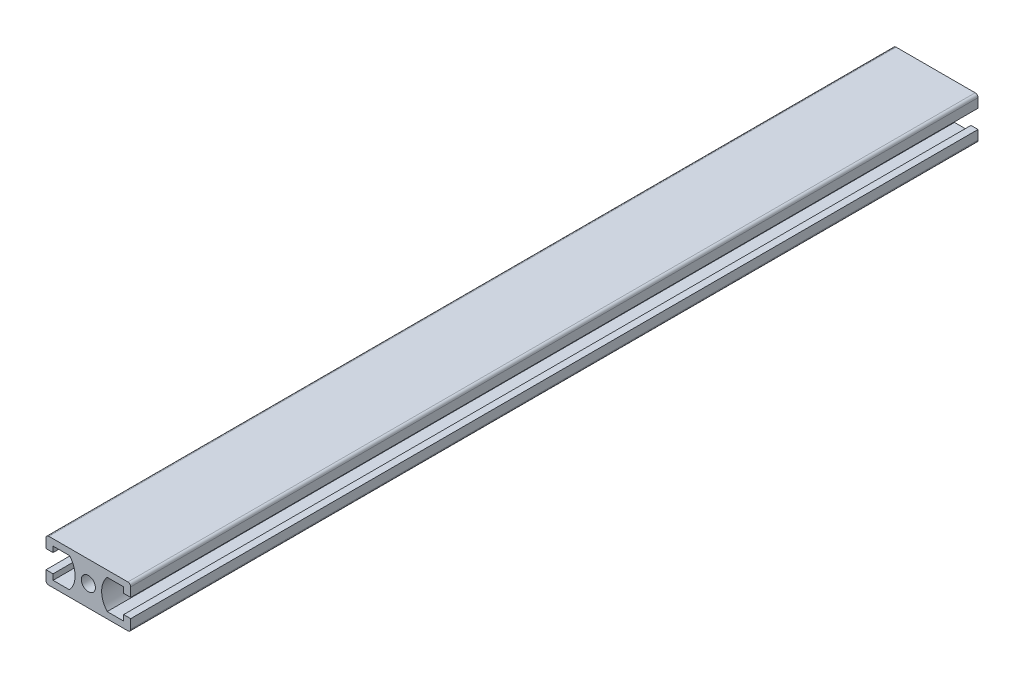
ISO-10303-21;
HEADER;
FILE_DESCRIPTION(('STEP AP214'),'2;1');
FILE_NAME('part.step','',(''),(''),'','','');
FILE_SCHEMA(('AUTOMOTIVE_DESIGN { 1 0 10303 214 1 1 1 1 }'));
ENDSEC;
DATA;
#1=APPLICATION_CONTEXT('core data for automotive mechanical design processes');
#2=APPLICATION_PROTOCOL_DEFINITION('international standard','automotive_design',2000,#1);
#3=PRODUCT_CONTEXT('',#1,'mechanical');
#4=PRODUCT('Part','Part','',(#3));
#5=PRODUCT_RELATED_PRODUCT_CATEGORY('part','',(#4));
#6=PRODUCT_DEFINITION_FORMATION('','',#4);
#7=PRODUCT_DEFINITION_CONTEXT('part definition',#1,'design');
#8=PRODUCT_DEFINITION('design','',#6,#7);
#9=PRODUCT_DEFINITION_SHAPE('','',#8);
#10=(LENGTH_UNIT() NAMED_UNIT(*) SI_UNIT(.MILLI.,.METRE.));
#11=(NAMED_UNIT(*) PLANE_ANGLE_UNIT() SI_UNIT($,.RADIAN.));
#12=(NAMED_UNIT(*) SI_UNIT($,.STERADIAN.) SOLID_ANGLE_UNIT());
#13=UNCERTAINTY_MEASURE_WITH_UNIT(LENGTH_MEASURE(1.E-05),#10,'distance_accuracy_value','');
#14=(GEOMETRIC_REPRESENTATION_CONTEXT(3) GLOBAL_UNCERTAINTY_ASSIGNED_CONTEXT((#13)) GLOBAL_UNIT_ASSIGNED_CONTEXT((#10,
#11,#12)) REPRESENTATION_CONTEXT('',''));
#15=CARTESIAN_POINT('',(0.,0.,0.));
#16=DIRECTION('',(0.,0.,1.));
#17=DIRECTION('',(1.,0.,0.));
#18=AXIS2_PLACEMENT_3D('',#15,#16,#17);
#19=CARTESIAN_POINT('',(-12.6999999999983,0.,150.));
#20=DIRECTION('',(0.,0.,1.));
#21=DIRECTION('',(1.,0.,0.));
#22=AXIS2_PLACEMENT_3D('',#19,#20,#21);
#23=PLANE('',#22);
#24=CARTESIAN_POINT('',(-12.6999999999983,0.,150.));
#25=DIRECTION('',(0.,0.,-1.));
#26=DIRECTION('',(1.,0.,0.));
#27=AXIS2_PLACEMENT_3D('',#24,#25,#26);
#28=CIRCLE('',#27,7.99999999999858);
#29=CARTESIAN_POINT('',(-6.66365176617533,5.25000000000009,150.));
#30=VERTEX_POINT('',#29);
#31=CARTESIAN_POINT('',(-6.66365176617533,-5.24999999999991,150.));
#32=VERTEX_POINT('',#31);
#33=EDGE_CURVE('E309',#30,#32,#28,.T.);
#34=ORIENTED_EDGE('',*,*,#33,.T.);
#35=DIRECTION('',(-1.,0.,0.));
#36=VECTOR('',#35,1.);
#37=CARTESIAN_POINT('',(-6.66365176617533,-5.24999999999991,150.));
#38=LINE('',#37,#36);
#39=CARTESIAN_POINT('',(-12.4999999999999,-5.24999999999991,150.));
#40=VERTEX_POINT('',#39);
#41=EDGE_CURVE('E148',#32,#40,#38,.T.);
#42=ORIENTED_EDGE('',*,*,#41,.T.);
#43=DIRECTION('',(0.,1.,0.));
#44=VECTOR('',#43,1.);
#45=CARTESIAN_POINT('',(-12.4999999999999,-5.24999999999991,150.));
#46=LINE('',#45,#44);
#47=CARTESIAN_POINT('',(-12.4999999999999,-3.24999999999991,150.));
#48=VERTEX_POINT('',#47);
#49=EDGE_CURVE('E394',#40,#48,#46,.T.);
#50=ORIENTED_EDGE('',*,*,#49,.T.);
#51=DIRECTION('',(-1.,0.,0.));
#52=VECTOR('',#51,1.);
#53=CARTESIAN_POINT('',(-12.4999999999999,-3.24999999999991,150.));
#54=LINE('',#53,#52);
#55=CARTESIAN_POINT('',(-14.9999999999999,-3.24999999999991,150.));
#56=VERTEX_POINT('',#55);
#57=EDGE_CURVE('E414',#48,#56,#54,.T.);
#58=ORIENTED_EDGE('',*,*,#57,.T.);
#59=DIRECTION('',(0.,-1.,0.));
#60=VECTOR('',#59,1.);
#61=CARTESIAN_POINT('',(-14.9999999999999,-3.24999999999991,150.));
#62=LINE('',#61,#60);
#63=CARTESIAN_POINT('',(-14.9999999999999,-6.49999999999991,150.));
#64=VERTEX_POINT('',#63);
#65=EDGE_CURVE('E410',#56,#64,#62,.T.);
#66=ORIENTED_EDGE('',*,*,#65,.T.);
#67=CARTESIAN_POINT('',(-13.9999999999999,-6.49999999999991,150.));
#68=DIRECTION('',(0.,0.,1.));
#69=DIRECTION('',(1.,0.,0.));
#70=AXIS2_PLACEMENT_3D('',#67,#68,#69);
#71=CIRCLE('',#70,1.);
#72=CARTESIAN_POINT('',(-13.9999999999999,-7.49999999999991,150.));
#73=VERTEX_POINT('',#72);
#74=EDGE_CURVE('E413',#64,#73,#71,.T.);
#75=ORIENTED_EDGE('',*,*,#74,.T.);
#76=DIRECTION('',(1.,0.,0.));
#77=VECTOR('',#76,1.);
#78=CARTESIAN_POINT('',(-13.9999999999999,-7.49999999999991,150.));
#79=LINE('',#78,#77);
#80=CARTESIAN_POINT('',(14.0000000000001,-7.49999999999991,150.));
#81=VERTEX_POINT('',#80);
#82=EDGE_CURVE('E418',#73,#81,#79,.T.);
#83=ORIENTED_EDGE('',*,*,#82,.T.);
#84=CARTESIAN_POINT('',(14.0000000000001,-6.49999999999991,150.));
#85=DIRECTION('',(0.,0.,1.));
#86=DIRECTION('',(1.,0.,0.));
#87=AXIS2_PLACEMENT_3D('',#84,#85,#86);
#88=CIRCLE('',#87,0.999999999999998);
#89=CARTESIAN_POINT('',(15.0000000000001,-6.49999999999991,150.));
#90=VERTEX_POINT('',#89);
#91=EDGE_CURVE('E426',#81,#90,#88,.T.);
#92=ORIENTED_EDGE('',*,*,#91,.T.);
#93=DIRECTION('',(0.,1.,0.));
#94=VECTOR('',#93,1.);
#95=CARTESIAN_POINT('',(15.0000000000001,-6.49999999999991,150.));
#96=LINE('',#95,#94);
#97=CARTESIAN_POINT('',(15.0000000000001,-3.24999999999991,150.));
#98=VERTEX_POINT('',#97);
#99=EDGE_CURVE('E429',#90,#98,#96,.T.);
#100=ORIENTED_EDGE('',*,*,#99,.T.);
#101=DIRECTION('',(-1.,0.,0.));
#102=VECTOR('',#101,1.);
#103=CARTESIAN_POINT('',(15.0000000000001,-3.24999999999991,150.));
#104=LINE('',#103,#102);
#105=CARTESIAN_POINT('',(12.5000000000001,-3.24999999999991,150.));
#106=VERTEX_POINT('',#105);
#107=EDGE_CURVE('E432',#98,#106,#104,.T.);
#108=ORIENTED_EDGE('',*,*,#107,.T.);
#109=DIRECTION('',(0.,-1.,0.));
#110=VECTOR('',#109,1.);
#111=CARTESIAN_POINT('',(12.5000000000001,-3.24999999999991,150.));
#112=LINE('',#111,#110);
#113=CARTESIAN_POINT('',(12.5000000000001,-5.24999999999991,150.));
#114=VERTEX_POINT('',#113);
#115=EDGE_CURVE('E435',#106,#114,#112,.T.);
#116=ORIENTED_EDGE('',*,*,#115,.T.);
#117=DIRECTION('',(-1.,0.,0.));
#118=VECTOR('',#117,1.);
#119=CARTESIAN_POINT('',(12.5000000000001,-5.24999999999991,150.));
#120=LINE('',#119,#118);
#121=CARTESIAN_POINT('',(6.6636517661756,-5.24999999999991,150.));
#122=VERTEX_POINT('',#121);
#123=EDGE_CURVE('E438',#114,#122,#120,.T.);
#124=ORIENTED_EDGE('',*,*,#123,.T.);
#125=CARTESIAN_POINT('',(12.6999999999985,0.,150.));
#126=DIRECTION('',(0.,0.,-1.));
#127=DIRECTION('',(1.,0.,0.));
#128=AXIS2_PLACEMENT_3D('',#125,#126,#127);
#129=CIRCLE('',#128,7.99999999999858);
#130=CARTESIAN_POINT('',(6.6636517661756,5.25000000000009,150.));
#131=VERTEX_POINT('',#130);
#132=EDGE_CURVE('E441',#122,#131,#129,.T.);
#133=ORIENTED_EDGE('',*,*,#132,.T.);
#134=DIRECTION('',(1.,0.,0.));
#135=VECTOR('',#134,1.);
#136=CARTESIAN_POINT('',(6.6636517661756,5.25000000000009,150.));
#137=LINE('',#136,#135);
#138=CARTESIAN_POINT('',(12.5000000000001,5.25000000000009,150.));
#139=VERTEX_POINT('',#138);
#140=EDGE_CURVE('E444',#131,#139,#137,.T.);
#141=ORIENTED_EDGE('',*,*,#140,.T.);
#142=DIRECTION('',(0.,-1.,0.));
#143=VECTOR('',#142,1.);
#144=CARTESIAN_POINT('',(12.5000000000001,5.25000000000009,150.));
#145=LINE('',#144,#143);
#146=CARTESIAN_POINT('',(12.5000000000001,3.25000000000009,150.));
#147=VERTEX_POINT('',#146);
#148=EDGE_CURVE('E447',#139,#147,#145,.T.);
#149=ORIENTED_EDGE('',*,*,#148,.T.);
#150=DIRECTION('',(1.,0.,0.));
#151=VECTOR('',#150,1.);
#152=CARTESIAN_POINT('',(12.5000000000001,3.25000000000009,150.));
#153=LINE('',#152,#151);
#154=CARTESIAN_POINT('',(15.0000000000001,3.25000000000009,150.));
#155=VERTEX_POINT('',#154);
#156=EDGE_CURVE('E450',#147,#155,#153,.T.);
#157=ORIENTED_EDGE('',*,*,#156,.T.);
#158=DIRECTION('',(0.,1.,0.));
#159=VECTOR('',#158,1.);
#160=CARTESIAN_POINT('',(15.0000000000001,3.25000000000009,150.));
#161=LINE('',#160,#159);
#162=CARTESIAN_POINT('',(15.0000000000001,6.50000000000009,150.));
#163=VERTEX_POINT('',#162);
#164=EDGE_CURVE('E453',#155,#163,#161,.T.);
#165=ORIENTED_EDGE('',*,*,#164,.T.);
#166=CARTESIAN_POINT('',(14.0000000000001,6.50000000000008,150.));
#167=DIRECTION('',(0.,0.,1.));
#168=DIRECTION('',(1.,0.,0.));
#169=AXIS2_PLACEMENT_3D('',#166,#167,#168);
#170=CIRCLE('',#169,1.00000000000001);
#171=CARTESIAN_POINT('',(14.0000000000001,7.50000000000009,150.));
#172=VERTEX_POINT('',#171);
#173=EDGE_CURVE('E455',#163,#172,#170,.T.);
#174=ORIENTED_EDGE('',*,*,#173,.T.);
#175=DIRECTION('',(-1.,0.,0.));
#176=VECTOR('',#175,1.);
#177=CARTESIAN_POINT('',(14.0000000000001,7.50000000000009,150.));
#178=LINE('',#177,#176);
#179=CARTESIAN_POINT('',(-13.9999999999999,7.50000000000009,150.));
#180=VERTEX_POINT('',#179);
#181=EDGE_CURVE('E458',#172,#180,#178,.T.);
#182=ORIENTED_EDGE('',*,*,#181,.T.);
#183=CARTESIAN_POINT('',(-13.9999999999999,6.50000000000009,150.));
#184=DIRECTION('',(0.,0.,1.));
#185=DIRECTION('',(1.,0.,0.));
#186=AXIS2_PLACEMENT_3D('',#183,#184,#185);
#187=CIRCLE('',#186,0.999999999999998);
#188=CARTESIAN_POINT('',(-14.9999999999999,6.50000000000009,150.));
#189=VERTEX_POINT('',#188);
#190=EDGE_CURVE('E461',#180,#189,#187,.T.);
#191=ORIENTED_EDGE('',*,*,#190,.T.);
#192=DIRECTION('',(0.,-1.,0.));
#193=VECTOR('',#192,1.);
#194=CARTESIAN_POINT('',(-14.9999999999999,6.50000000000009,150.));
#195=LINE('',#194,#193);
#196=CARTESIAN_POINT('',(-14.9999999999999,3.25000000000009,150.));
#197=VERTEX_POINT('',#196);
#198=EDGE_CURVE('E215',#189,#197,#195,.T.);
#199=ORIENTED_EDGE('',*,*,#198,.T.);
#200=DIRECTION('',(1.,0.,0.));
#201=VECTOR('',#200,1.);
#202=CARTESIAN_POINT('',(-14.9999999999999,3.25000000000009,150.));
#203=LINE('',#202,#201);
#204=CARTESIAN_POINT('',(-12.4999999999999,3.25000000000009,150.));
#205=VERTEX_POINT('',#204);
#206=EDGE_CURVE('E209',#197,#205,#203,.T.);
#207=ORIENTED_EDGE('',*,*,#206,.T.);
#208=DIRECTION('',(0.,1.,0.));
#209=VECTOR('',#208,1.);
#210=CARTESIAN_POINT('',(-12.4999999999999,3.25000000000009,150.));
#211=LINE('',#210,#209);
#212=CARTESIAN_POINT('',(-12.4999999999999,5.25000000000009,150.));
#213=VERTEX_POINT('',#212);
#214=EDGE_CURVE('E213',#205,#213,#211,.T.);
#215=ORIENTED_EDGE('',*,*,#214,.T.);
#216=DIRECTION('',(1.,0.,0.));
#217=VECTOR('',#216,1.);
#218=CARTESIAN_POINT('',(-12.4999999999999,5.25000000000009,150.));
#219=LINE('',#218,#217);
#220=EDGE_CURVE('E57',#213,#30,#219,.T.);
#221=ORIENTED_EDGE('',*,*,#220,.T.);
#222=EDGE_LOOP('',(#34,#42,#50,#58,#66,#75,#83,#92,#100,#108,#116,#124,#133,#141,#149,#157,#165,
#174,#182,#191,#199,#207,#215,#221));
#223=FACE_BOUND('',#222,.T.);
#224=CARTESIAN_POINT('',(1.35308431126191E-13,0.,150.));
#225=DIRECTION('',(0.,0.,1.));
#226=DIRECTION('',(1.,0.,0.));
#227=AXIS2_PLACEMENT_3D('',#224,#225,#226);
#228=CIRCLE('',#227,2.5);
#229=CARTESIAN_POINT('',(2.50000000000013,0.,150.));
#230=VERTEX_POINT('',#229);
#231=EDGE_CURVE('E244',#230,#230,#228,.T.);
#232=ORIENTED_EDGE('',*,*,#231,.F.);
#233=EDGE_LOOP('',(#232));
#234=FACE_BOUND('',#233,.T.);
#235=ADVANCED_FACE('F39',(#223,#234),#23,.T.);
#236=CARTESIAN_POINT('',(-12.6999999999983,0.,-150.));
#237=DIRECTION('',(0.,0.,1.));
#238=DIRECTION('',(1.,0.,0.));
#239=AXIS2_PLACEMENT_3D('',#236,#237,#238);
#240=PLANE('',#239);
#241=CARTESIAN_POINT('',(-12.6999999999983,0.,-150.));
#242=DIRECTION('',(0.,0.,-1.));
#243=DIRECTION('',(1.,0.,0.));
#244=AXIS2_PLACEMENT_3D('',#241,#242,#243);
#245=CIRCLE('',#244,7.99999999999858);
#246=CARTESIAN_POINT('',(-6.66365176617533,5.25000000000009,-150.));
#247=VERTEX_POINT('',#246);
#248=CARTESIAN_POINT('',(-6.66365176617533,-5.24999999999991,-150.));
#249=VERTEX_POINT('',#248);
#250=EDGE_CURVE('E239',#247,#249,#245,.T.);
#251=ORIENTED_EDGE('',*,*,#250,.F.);
#252=DIRECTION('',(1.,0.,0.));
#253=VECTOR('',#252,1.);
#254=CARTESIAN_POINT('',(-12.4999999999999,5.25000000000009,-150.));
#255=LINE('',#254,#253);
#256=CARTESIAN_POINT('',(-12.4999999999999,5.25000000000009,-150.));
#257=VERTEX_POINT('',#256);
#258=EDGE_CURVE('E140',#257,#247,#255,.T.);
#259=ORIENTED_EDGE('',*,*,#258,.F.);
#260=DIRECTION('',(0.,1.,0.));
#261=VECTOR('',#260,1.);
#262=CARTESIAN_POINT('',(-12.4999999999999,3.25000000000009,-150.));
#263=LINE('',#262,#261);
#264=CARTESIAN_POINT('',(-12.4999999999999,3.25000000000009,-150.));
#265=VERTEX_POINT('',#264);
#266=EDGE_CURVE('E134',#265,#257,#263,.T.);
#267=ORIENTED_EDGE('',*,*,#266,.F.);
#268=DIRECTION('',(1.,0.,0.));
#269=VECTOR('',#268,1.);
#270=CARTESIAN_POINT('',(-14.9999999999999,3.25000000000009,-150.));
#271=LINE('',#270,#269);
#272=CARTESIAN_POINT('',(-14.9999999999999,3.25000000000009,-150.));
#273=VERTEX_POINT('',#272);
#274=EDGE_CURVE('E224',#273,#265,#271,.T.);
#275=ORIENTED_EDGE('',*,*,#274,.F.);
#276=DIRECTION('',(0.,-1.,0.));
#277=VECTOR('',#276,1.);
#278=CARTESIAN_POINT('',(-14.9999999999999,6.50000000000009,-150.));
#279=LINE('',#278,#277);
#280=CARTESIAN_POINT('',(-14.9999999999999,6.50000000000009,-150.));
#281=VERTEX_POINT('',#280);
#282=EDGE_CURVE('E300',#281,#273,#279,.T.);
#283=ORIENTED_EDGE('',*,*,#282,.F.);
#284=CARTESIAN_POINT('',(-13.9999999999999,6.50000000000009,-150.));
#285=DIRECTION('',(0.,0.,1.));
#286=DIRECTION('',(1.,0.,0.));
#287=AXIS2_PLACEMENT_3D('',#284,#285,#286);
#288=CIRCLE('',#287,0.999999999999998);
#289=CARTESIAN_POINT('',(-13.9999999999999,7.50000000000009,-150.));
#290=VERTEX_POINT('',#289);
#291=EDGE_CURVE('E297',#290,#281,#288,.T.);
#292=ORIENTED_EDGE('',*,*,#291,.F.);
#293=DIRECTION('',(-1.,0.,0.));
#294=VECTOR('',#293,1.);
#295=CARTESIAN_POINT('',(14.0000000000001,7.50000000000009,-150.));
#296=LINE('',#295,#294);
#297=CARTESIAN_POINT('',(14.0000000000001,7.50000000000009,-150.));
#298=VERTEX_POINT('',#297);
#299=EDGE_CURVE('E294',#298,#290,#296,.T.);
#300=ORIENTED_EDGE('',*,*,#299,.F.);
#301=CARTESIAN_POINT('',(14.0000000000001,6.50000000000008,-150.));
#302=DIRECTION('',(0.,0.,1.));
#303=DIRECTION('',(1.,0.,0.));
#304=AXIS2_PLACEMENT_3D('',#301,#302,#303);
#305=CIRCLE('',#304,1.00000000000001);
#306=CARTESIAN_POINT('',(15.0000000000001,6.50000000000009,-150.));
#307=VERTEX_POINT('',#306);
#308=EDGE_CURVE('E291',#307,#298,#305,.T.);
#309=ORIENTED_EDGE('',*,*,#308,.F.);
#310=DIRECTION('',(0.,1.,0.));
#311=VECTOR('',#310,1.);
#312=CARTESIAN_POINT('',(15.0000000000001,3.25000000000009,-150.));
#313=LINE('',#312,#311);
#314=CARTESIAN_POINT('',(15.0000000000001,3.25000000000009,-150.));
#315=VERTEX_POINT('',#314);
#316=EDGE_CURVE('E288',#315,#307,#313,.T.);
#317=ORIENTED_EDGE('',*,*,#316,.F.);
#318=DIRECTION('',(1.,0.,0.));
#319=VECTOR('',#318,1.);
#320=CARTESIAN_POINT('',(12.5000000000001,3.25000000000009,-150.));
#321=LINE('',#320,#319);
#322=CARTESIAN_POINT('',(12.5000000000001,3.25000000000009,-150.));
#323=VERTEX_POINT('',#322);
#324=EDGE_CURVE('E285',#323,#315,#321,.T.);
#325=ORIENTED_EDGE('',*,*,#324,.F.);
#326=DIRECTION('',(0.,-1.,0.));
#327=VECTOR('',#326,1.);
#328=CARTESIAN_POINT('',(12.5000000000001,5.25000000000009,-150.));
#329=LINE('',#328,#327);
#330=CARTESIAN_POINT('',(12.5000000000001,5.25000000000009,-150.));
#331=VERTEX_POINT('',#330);
#332=EDGE_CURVE('E282',#331,#323,#329,.T.);
#333=ORIENTED_EDGE('',*,*,#332,.F.);
#334=DIRECTION('',(1.,0.,0.));
#335=VECTOR('',#334,1.);
#336=CARTESIAN_POINT('',(6.6636517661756,5.25000000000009,-150.));
#337=LINE('',#336,#335);
#338=CARTESIAN_POINT('',(6.6636517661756,5.25000000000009,-150.));
#339=VERTEX_POINT('',#338);
#340=EDGE_CURVE('E280',#339,#331,#337,.T.);
#341=ORIENTED_EDGE('',*,*,#340,.F.);
#342=CARTESIAN_POINT('',(12.6999999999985,0.,-150.));
#343=DIRECTION('',(0.,0.,-1.));
#344=DIRECTION('',(1.,0.,0.));
#345=AXIS2_PLACEMENT_3D('',#342,#343,#344);
#346=CIRCLE('',#345,7.99999999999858);
#347=CARTESIAN_POINT('',(6.6636517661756,-5.24999999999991,-150.));
#348=VERTEX_POINT('',#347);
#349=EDGE_CURVE('E277',#348,#339,#346,.T.);
#350=ORIENTED_EDGE('',*,*,#349,.F.);
#351=DIRECTION('',(-1.,0.,0.));
#352=VECTOR('',#351,1.);
#353=CARTESIAN_POINT('',(12.5000000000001,-5.24999999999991,-150.));
#354=LINE('',#353,#352);
#355=CARTESIAN_POINT('',(12.5000000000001,-5.24999999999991,-150.));
#356=VERTEX_POINT('',#355);
#357=EDGE_CURVE('E274',#356,#348,#354,.T.);
#358=ORIENTED_EDGE('',*,*,#357,.F.);
#359=DIRECTION('',(0.,-1.,0.));
#360=VECTOR('',#359,1.);
#361=CARTESIAN_POINT('',(12.5000000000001,-3.24999999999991,-150.));
#362=LINE('',#361,#360);
#363=CARTESIAN_POINT('',(12.5000000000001,-3.24999999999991,-150.));
#364=VERTEX_POINT('',#363);
#365=EDGE_CURVE('E271',#364,#356,#362,.T.);
#366=ORIENTED_EDGE('',*,*,#365,.F.);
#367=DIRECTION('',(-1.,0.,0.));
#368=VECTOR('',#367,1.);
#369=CARTESIAN_POINT('',(15.0000000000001,-3.24999999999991,-150.));
#370=LINE('',#369,#368);
#371=CARTESIAN_POINT('',(15.0000000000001,-3.24999999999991,-150.));
#372=VERTEX_POINT('',#371);
#373=EDGE_CURVE('E268',#372,#364,#370,.T.);
#374=ORIENTED_EDGE('',*,*,#373,.F.);
#375=DIRECTION('',(0.,1.,0.));
#376=VECTOR('',#375,1.);
#377=CARTESIAN_POINT('',(15.0000000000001,-6.49999999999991,-150.));
#378=LINE('',#377,#376);
#379=CARTESIAN_POINT('',(15.0000000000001,-6.49999999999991,-150.));
#380=VERTEX_POINT('',#379);
#381=EDGE_CURVE('E265',#380,#372,#378,.T.);
#382=ORIENTED_EDGE('',*,*,#381,.F.);
#383=CARTESIAN_POINT('',(14.0000000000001,-6.49999999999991,-150.));
#384=DIRECTION('',(0.,0.,1.));
#385=DIRECTION('',(1.,0.,0.));
#386=AXIS2_PLACEMENT_3D('',#383,#384,#385);
#387=CIRCLE('',#386,0.999999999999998);
#388=CARTESIAN_POINT('',(14.0000000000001,-7.49999999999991,-150.));
#389=VERTEX_POINT('',#388);
#390=EDGE_CURVE('E262',#389,#380,#387,.T.);
#391=ORIENTED_EDGE('',*,*,#390,.F.);
#392=DIRECTION('',(1.,0.,0.));
#393=VECTOR('',#392,1.);
#394=CARTESIAN_POINT('',(-13.9999999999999,-7.49999999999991,-150.));
#395=LINE('',#394,#393);
#396=CARTESIAN_POINT('',(-13.9999999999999,-7.49999999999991,-150.));
#397=VERTEX_POINT('',#396);
#398=EDGE_CURVE('E259',#397,#389,#395,.T.);
#399=ORIENTED_EDGE('',*,*,#398,.F.);
#400=CARTESIAN_POINT('',(-13.9999999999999,-6.49999999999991,-150.));
#401=DIRECTION('',(0.,0.,1.));
#402=DIRECTION('',(1.,0.,0.));
#403=AXIS2_PLACEMENT_3D('',#400,#401,#402);
#404=CIRCLE('',#403,1.);
#405=CARTESIAN_POINT('',(-14.9999999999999,-6.49999999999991,-150.));
#406=VERTEX_POINT('',#405);
#407=EDGE_CURVE('E256',#406,#397,#404,.T.);
#408=ORIENTED_EDGE('',*,*,#407,.F.);
#409=DIRECTION('',(0.,-1.,0.));
#410=VECTOR('',#409,1.);
#411=CARTESIAN_POINT('',(-14.9999999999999,-3.24999999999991,-150.));
#412=LINE('',#411,#410);
#413=CARTESIAN_POINT('',(-14.9999999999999,-3.24999999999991,-150.));
#414=VERTEX_POINT('',#413);
#415=EDGE_CURVE('E253',#414,#406,#412,.T.);
#416=ORIENTED_EDGE('',*,*,#415,.F.);
#417=DIRECTION('',(-1.,0.,0.));
#418=VECTOR('',#417,1.);
#419=CARTESIAN_POINT('',(-12.4999999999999,-3.24999999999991,-150.));
#420=LINE('',#419,#418);
#421=CARTESIAN_POINT('',(-12.4999999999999,-3.24999999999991,-150.));
#422=VERTEX_POINT('',#421);
#423=EDGE_CURVE('E250',#422,#414,#420,.T.);
#424=ORIENTED_EDGE('',*,*,#423,.F.);
#425=DIRECTION('',(0.,1.,0.));
#426=VECTOR('',#425,1.);
#427=CARTESIAN_POINT('',(-12.4999999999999,-5.24999999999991,-150.));
#428=LINE('',#427,#426);
#429=CARTESIAN_POINT('',(-12.4999999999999,-5.24999999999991,-150.));
#430=VERTEX_POINT('',#429);
#431=EDGE_CURVE('E247',#430,#422,#428,.T.);
#432=ORIENTED_EDGE('',*,*,#431,.F.);
#433=DIRECTION('',(-1.,0.,0.));
#434=VECTOR('',#433,1.);
#435=CARTESIAN_POINT('',(-6.66365176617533,-5.24999999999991,-150.));
#436=LINE('',#435,#434);
#437=EDGE_CURVE('E243',#249,#430,#436,.T.);
#438=ORIENTED_EDGE('',*,*,#437,.F.);
#439=EDGE_LOOP('',(#251,#259,#267,#275,#283,#292,#300,#309,#317,#325,#333,#341,#350,#358,#366,
#374,#382,#391,#399,#408,#416,#424,#432,#438));
#440=FACE_BOUND('',#439,.T.);
#441=CARTESIAN_POINT('',(1.35308431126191E-13,0.,-150.));
#442=DIRECTION('',(0.,0.,1.));
#443=DIRECTION('',(1.,0.,0.));
#444=AXIS2_PLACEMENT_3D('',#441,#442,#443);
#445=CIRCLE('',#444,2.5);
#446=CARTESIAN_POINT('',(2.50000000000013,0.,-150.));
#447=VERTEX_POINT('',#446);
#448=EDGE_CURVE('E792',#447,#447,#445,.T.);
#449=ORIENTED_EDGE('',*,*,#448,.T.);
#450=EDGE_LOOP('',(#449));
#451=FACE_BOUND('',#450,.T.);
#452=ADVANCED_FACE('F398',(#440,#451),#240,.F.);
#453=CARTESIAN_POINT('',(-12.6999999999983,0.,150.));
#454=DIRECTION('',(0.,0.,-1.));
#455=DIRECTION('',(-1.,0.,0.));
#456=AXIS2_PLACEMENT_3D('',#453,#454,#455);
#457=CYLINDRICAL_SURFACE('',#456,7.99999999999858);
#458=ORIENTED_EDGE('',*,*,#250,.T.);
#459=DIRECTION('',(0.,0.,-1.));
#460=VECTOR('',#459,1.);
#461=CARTESIAN_POINT('',(-6.66365176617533,-5.24999999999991,150.));
#462=LINE('',#461,#460);
#463=EDGE_CURVE('E11',#32,#249,#462,.T.);
#464=ORIENTED_EDGE('',*,*,#463,.F.);
#465=ORIENTED_EDGE('',*,*,#33,.F.);
#466=DIRECTION('',(0.,0.,-1.));
#467=VECTOR('',#466,1.);
#468=CARTESIAN_POINT('',(-6.66365176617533,5.25000000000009,150.));
#469=LINE('',#468,#467);
#470=EDGE_CURVE('E235',#30,#247,#469,.T.);
#471=ORIENTED_EDGE('',*,*,#470,.T.);
#472=EDGE_LOOP('',(#458,#464,#465,#471));
#473=FACE_BOUND('',#472,.T.);
#474=ADVANCED_FACE('F41',(#473),#457,.F.);
#475=CARTESIAN_POINT('',(-6.66365176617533,-5.24999999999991,150.));
#476=DIRECTION('',(0.,-1.,0.));
#477=DIRECTION('',(0.,0.,-1.));
#478=AXIS2_PLACEMENT_3D('',#475,#476,#477);
#479=PLANE('',#478);
#480=ORIENTED_EDGE('',*,*,#437,.T.);
#481=DIRECTION('',(0.,0.,-1.));
#482=VECTOR('',#481,1.);
#483=CARTESIAN_POINT('',(-12.4999999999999,-5.24999999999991,150.));
#484=LINE('',#483,#482);
#485=EDGE_CURVE('E49',#40,#430,#484,.T.);
#486=ORIENTED_EDGE('',*,*,#485,.F.);
#487=ORIENTED_EDGE('',*,*,#41,.F.);
#488=ORIENTED_EDGE('',*,*,#463,.T.);
#489=EDGE_LOOP('',(#480,#486,#487,#488));
#490=FACE_BOUND('',#489,.T.);
#491=ADVANCED_FACE('F496',(#490),#479,.F.);
#492=CARTESIAN_POINT('',(-12.4999999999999,-5.24999999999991,150.));
#493=DIRECTION('',(-1.,0.,0.));
#494=DIRECTION('',(0.,0.,1.));
#495=AXIS2_PLACEMENT_3D('',#492,#493,#494);
#496=PLANE('',#495);
#497=ORIENTED_EDGE('',*,*,#431,.T.);
#498=DIRECTION('',(0.,0.,-1.));
#499=VECTOR('',#498,1.);
#500=CARTESIAN_POINT('',(-12.4999999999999,-3.24999999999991,150.));
#501=LINE('',#500,#499);
#502=EDGE_CURVE('E384',#48,#422,#501,.T.);
#503=ORIENTED_EDGE('',*,*,#502,.F.);
#504=ORIENTED_EDGE('',*,*,#49,.F.);
#505=ORIENTED_EDGE('',*,*,#485,.T.);
#506=EDGE_LOOP('',(#497,#503,#504,#505));
#507=FACE_BOUND('',#506,.T.);
#508=ADVANCED_FACE('F392',(#507),#496,.F.);
#509=CARTESIAN_POINT('',(-12.4999999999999,-3.24999999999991,150.));
#510=DIRECTION('',(0.,-1.,0.));
#511=DIRECTION('',(0.,0.,-1.));
#512=AXIS2_PLACEMENT_3D('',#509,#510,#511);
#513=PLANE('',#512);
#514=ORIENTED_EDGE('',*,*,#423,.T.);
#515=DIRECTION('',(0.,0.,-1.));
#516=VECTOR('',#515,1.);
#517=CARTESIAN_POINT('',(-14.9999999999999,-3.24999999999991,150.));
#518=LINE('',#517,#516);
#519=EDGE_CURVE('E380',#56,#414,#518,.T.);
#520=ORIENTED_EDGE('',*,*,#519,.F.);
#521=ORIENTED_EDGE('',*,*,#57,.F.);
#522=ORIENTED_EDGE('',*,*,#502,.T.);
#523=EDGE_LOOP('',(#514,#520,#521,#522));
#524=FACE_BOUND('',#523,.T.);
#525=ADVANCED_FACE('F404',(#524),#513,.F.);
#526=CARTESIAN_POINT('',(-14.9999999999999,-3.24999999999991,150.));
#527=DIRECTION('',(1.,0.,0.));
#528=DIRECTION('',(0.,0.,-1.));
#529=AXIS2_PLACEMENT_3D('',#526,#527,#528);
#530=PLANE('',#529);
#531=ORIENTED_EDGE('',*,*,#415,.T.);
#532=DIRECTION('',(0.,0.,-1.));
#533=VECTOR('',#532,1.);
#534=CARTESIAN_POINT('',(-14.9999999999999,-6.49999999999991,150.));
#535=LINE('',#534,#533);
#536=EDGE_CURVE('E376',#64,#406,#535,.T.);
#537=ORIENTED_EDGE('',*,*,#536,.F.);
#538=ORIENTED_EDGE('',*,*,#65,.F.);
#539=ORIENTED_EDGE('',*,*,#519,.T.);
#540=EDGE_LOOP('',(#531,#537,#538,#539));
#541=FACE_BOUND('',#540,.T.);
#542=ADVANCED_FACE('F408',(#541),#530,.F.);
#543=CARTESIAN_POINT('',(-13.9999999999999,-6.49999999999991,150.));
#544=DIRECTION('',(0.,0.,-1.));
#545=DIRECTION('',(-1.,0.,0.));
#546=AXIS2_PLACEMENT_3D('',#543,#544,#545);
#547=CYLINDRICAL_SURFACE('',#546,1.);
#548=ORIENTED_EDGE('',*,*,#407,.T.);
#549=DIRECTION('',(0.,0.,-1.));
#550=VECTOR('',#549,1.);
#551=CARTESIAN_POINT('',(-13.9999999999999,-7.49999999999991,150.));
#552=LINE('',#551,#550);
#553=EDGE_CURVE('E372',#73,#397,#552,.T.);
#554=ORIENTED_EDGE('',*,*,#553,.F.);
#555=ORIENTED_EDGE('',*,*,#74,.F.);
#556=ORIENTED_EDGE('',*,*,#536,.T.);
#557=EDGE_LOOP('',(#548,#554,#555,#556));
#558=FACE_BOUND('',#557,.T.);
#559=ADVANCED_FACE('F509',(#558),#547,.T.);
#560=CARTESIAN_POINT('',(-13.9999999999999,-7.49999999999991,150.));
#561=DIRECTION('',(0.,1.,0.));
#562=DIRECTION('',(0.,0.,1.));
#563=AXIS2_PLACEMENT_3D('',#560,#561,#562);
#564=PLANE('',#563);
#565=ORIENTED_EDGE('',*,*,#398,.T.);
#566=DIRECTION('',(0.,0.,-1.));
#567=VECTOR('',#566,1.);
#568=CARTESIAN_POINT('',(14.0000000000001,-7.49999999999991,150.));
#569=LINE('',#568,#567);
#570=EDGE_CURVE('E368',#81,#389,#569,.T.);
#571=ORIENTED_EDGE('',*,*,#570,.F.);
#572=ORIENTED_EDGE('',*,*,#82,.F.);
#573=ORIENTED_EDGE('',*,*,#553,.T.);
#574=EDGE_LOOP('',(#565,#571,#572,#573));
#575=FACE_BOUND('',#574,.T.);
#576=ADVANCED_FACE('F512',(#575),#564,.F.);
#577=CARTESIAN_POINT('',(14.0000000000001,-6.49999999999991,150.));
#578=DIRECTION('',(0.,0.,-1.));
#579=DIRECTION('',(-1.,0.,0.));
#580=AXIS2_PLACEMENT_3D('',#577,#578,#579);
#581=CYLINDRICAL_SURFACE('',#580,0.999999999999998);
#582=ORIENTED_EDGE('',*,*,#390,.T.);
#583=DIRECTION('',(0.,0.,-1.));
#584=VECTOR('',#583,1.);
#585=CARTESIAN_POINT('',(15.0000000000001,-6.49999999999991,150.));
#586=LINE('',#585,#584);
#587=EDGE_CURVE('E364',#90,#380,#586,.T.);
#588=ORIENTED_EDGE('',*,*,#587,.F.);
#589=ORIENTED_EDGE('',*,*,#91,.F.);
#590=ORIENTED_EDGE('',*,*,#570,.T.);
#591=EDGE_LOOP('',(#582,#588,#589,#590));
#592=FACE_BOUND('',#591,.T.);
#593=ADVANCED_FACE('F516',(#592),#581,.T.);
#594=CARTESIAN_POINT('',(15.0000000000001,-6.49999999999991,150.));
#595=DIRECTION('',(-1.,0.,0.));
#596=DIRECTION('',(0.,-1.,0.));
#597=AXIS2_PLACEMENT_3D('',#594,#595,#596);
#598=PLANE('',#597);
#599=ORIENTED_EDGE('',*,*,#381,.T.);
#600=DIRECTION('',(0.,0.,-1.));
#601=VECTOR('',#600,1.);
#602=CARTESIAN_POINT('',(15.0000000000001,-3.24999999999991,150.));
#603=LINE('',#602,#601);
#604=EDGE_CURVE('E360',#98,#372,#603,.T.);
#605=ORIENTED_EDGE('',*,*,#604,.F.);
#606=ORIENTED_EDGE('',*,*,#99,.F.);
#607=ORIENTED_EDGE('',*,*,#587,.T.);
#608=EDGE_LOOP('',(#599,#605,#606,#607));
#609=FACE_BOUND('',#608,.T.);
#610=ADVANCED_FACE('F520',(#609),#598,.F.);
#611=CARTESIAN_POINT('',(15.0000000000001,-3.24999999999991,150.));
#612=DIRECTION('',(0.,-1.,0.));
#613=DIRECTION('',(0.,0.,-1.));
#614=AXIS2_PLACEMENT_3D('',#611,#612,#613);
#615=PLANE('',#614);
#616=ORIENTED_EDGE('',*,*,#373,.T.);
#617=DIRECTION('',(0.,0.,-1.));
#618=VECTOR('',#617,1.);
#619=CARTESIAN_POINT('',(12.5000000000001,-3.24999999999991,150.));
#620=LINE('',#619,#618);
#621=EDGE_CURVE('E356',#106,#364,#620,.T.);
#622=ORIENTED_EDGE('',*,*,#621,.F.);
#623=ORIENTED_EDGE('',*,*,#107,.F.);
#624=ORIENTED_EDGE('',*,*,#604,.T.);
#625=EDGE_LOOP('',(#616,#622,#623,#624));
#626=FACE_BOUND('',#625,.T.);
#627=ADVANCED_FACE('F524',(#626),#615,.F.);
#628=CARTESIAN_POINT('',(12.5000000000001,-3.24999999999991,150.));
#629=DIRECTION('',(1.,0.,0.));
#630=DIRECTION('',(0.,0.,-1.));
#631=AXIS2_PLACEMENT_3D('',#628,#629,#630);
#632=PLANE('',#631);
#633=ORIENTED_EDGE('',*,*,#365,.T.);
#634=DIRECTION('',(0.,0.,-1.));
#635=VECTOR('',#634,1.);
#636=CARTESIAN_POINT('',(12.5000000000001,-5.24999999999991,150.));
#637=LINE('',#636,#635);
#638=EDGE_CURVE('E352',#114,#356,#637,.T.);
#639=ORIENTED_EDGE('',*,*,#638,.F.);
#640=ORIENTED_EDGE('',*,*,#115,.F.);
#641=ORIENTED_EDGE('',*,*,#621,.T.);
#642=EDGE_LOOP('',(#633,#639,#640,#641));
#643=FACE_BOUND('',#642,.T.);
#644=ADVANCED_FACE('F528',(#643),#632,.F.);
#645=CARTESIAN_POINT('',(12.5000000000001,-5.24999999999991,150.));
#646=DIRECTION('',(0.,-1.,0.));
#647=DIRECTION('',(0.,0.,-1.));
#648=AXIS2_PLACEMENT_3D('',#645,#646,#647);
#649=PLANE('',#648);
#650=ORIENTED_EDGE('',*,*,#357,.T.);
#651=DIRECTION('',(0.,0.,-1.));
#652=VECTOR('',#651,1.);
#653=CARTESIAN_POINT('',(6.6636517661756,-5.24999999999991,150.));
#654=LINE('',#653,#652);
#655=EDGE_CURVE('E348',#122,#348,#654,.T.);
#656=ORIENTED_EDGE('',*,*,#655,.F.);
#657=ORIENTED_EDGE('',*,*,#123,.F.);
#658=ORIENTED_EDGE('',*,*,#638,.T.);
#659=EDGE_LOOP('',(#650,#656,#657,#658));
#660=FACE_BOUND('',#659,.T.);
#661=ADVANCED_FACE('F532',(#660),#649,.F.);
#662=CARTESIAN_POINT('',(12.6999999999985,0.,150.));
#663=DIRECTION('',(0.,0.,-1.));
#664=DIRECTION('',(-1.,0.,0.));
#665=AXIS2_PLACEMENT_3D('',#662,#663,#664);
#666=CYLINDRICAL_SURFACE('',#665,7.99999999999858);
#667=ORIENTED_EDGE('',*,*,#349,.T.);
#668=DIRECTION('',(0.,0.,-1.));
#669=VECTOR('',#668,1.);
#670=CARTESIAN_POINT('',(6.6636517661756,5.25000000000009,150.));
#671=LINE('',#670,#669);
#672=EDGE_CURVE('E344',#131,#339,#671,.T.);
#673=ORIENTED_EDGE('',*,*,#672,.F.);
#674=ORIENTED_EDGE('',*,*,#132,.F.);
#675=ORIENTED_EDGE('',*,*,#655,.T.);
#676=EDGE_LOOP('',(#667,#673,#674,#675));
#677=FACE_BOUND('',#676,.T.);
#678=ADVANCED_FACE('F536',(#677),#666,.F.);
#679=CARTESIAN_POINT('',(6.6636517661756,5.25000000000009,150.));
#680=DIRECTION('',(0.,1.,0.));
#681=DIRECTION('',(0.,0.,1.));
#682=AXIS2_PLACEMENT_3D('',#679,#680,#681);
#683=PLANE('',#682);
#684=ORIENTED_EDGE('',*,*,#340,.T.);
#685=DIRECTION('',(0.,0.,-1.));
#686=VECTOR('',#685,1.);
#687=CARTESIAN_POINT('',(12.5000000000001,5.25000000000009,150.));
#688=LINE('',#687,#686);
#689=EDGE_CURVE('E340',#139,#331,#688,.T.);
#690=ORIENTED_EDGE('',*,*,#689,.F.);
#691=ORIENTED_EDGE('',*,*,#140,.F.);
#692=ORIENTED_EDGE('',*,*,#672,.T.);
#693=EDGE_LOOP('',(#684,#690,#691,#692));
#694=FACE_BOUND('',#693,.T.);
#695=ADVANCED_FACE('F540',(#694),#683,.F.);
#696=CARTESIAN_POINT('',(12.5000000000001,5.25000000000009,150.));
#697=DIRECTION('',(1.,0.,0.));
#698=DIRECTION('',(0.,0.,-1.));
#699=AXIS2_PLACEMENT_3D('',#696,#697,#698);
#700=PLANE('',#699);
#701=ORIENTED_EDGE('',*,*,#332,.T.);
#702=DIRECTION('',(0.,0.,-1.));
#703=VECTOR('',#702,1.);
#704=CARTESIAN_POINT('',(12.5000000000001,3.25000000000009,150.));
#705=LINE('',#704,#703);
#706=EDGE_CURVE('E336',#147,#323,#705,.T.);
#707=ORIENTED_EDGE('',*,*,#706,.F.);
#708=ORIENTED_EDGE('',*,*,#148,.F.);
#709=ORIENTED_EDGE('',*,*,#689,.T.);
#710=EDGE_LOOP('',(#701,#707,#708,#709));
#711=FACE_BOUND('',#710,.T.);
#712=ADVANCED_FACE('F544',(#711),#700,.F.);
#713=CARTESIAN_POINT('',(12.5000000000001,3.25000000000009,150.));
#714=DIRECTION('',(0.,1.,0.));
#715=DIRECTION('',(0.,0.,1.));
#716=AXIS2_PLACEMENT_3D('',#713,#714,#715);
#717=PLANE('',#716);
#718=ORIENTED_EDGE('',*,*,#324,.T.);
#719=DIRECTION('',(0.,0.,-1.));
#720=VECTOR('',#719,1.);
#721=CARTESIAN_POINT('',(15.0000000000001,3.25000000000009,150.));
#722=LINE('',#721,#720);
#723=EDGE_CURVE('E332',#155,#315,#722,.T.);
#724=ORIENTED_EDGE('',*,*,#723,.F.);
#725=ORIENTED_EDGE('',*,*,#156,.F.);
#726=ORIENTED_EDGE('',*,*,#706,.T.);
#727=EDGE_LOOP('',(#718,#724,#725,#726));
#728=FACE_BOUND('',#727,.T.);
#729=ADVANCED_FACE('F548',(#728),#717,.F.);
#730=CARTESIAN_POINT('',(15.0000000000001,3.25000000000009,150.));
#731=DIRECTION('',(-1.,0.,0.));
#732=DIRECTION('',(0.,0.,1.));
#733=AXIS2_PLACEMENT_3D('',#730,#731,#732);
#734=PLANE('',#733);
#735=ORIENTED_EDGE('',*,*,#316,.T.);
#736=DIRECTION('',(0.,0.,-1.));
#737=VECTOR('',#736,1.);
#738=CARTESIAN_POINT('',(15.0000000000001,6.50000000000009,150.));
#739=LINE('',#738,#737);
#740=EDGE_CURVE('E328',#163,#307,#739,.T.);
#741=ORIENTED_EDGE('',*,*,#740,.F.);
#742=ORIENTED_EDGE('',*,*,#164,.F.);
#743=ORIENTED_EDGE('',*,*,#723,.T.);
#744=EDGE_LOOP('',(#735,#741,#742,#743));
#745=FACE_BOUND('',#744,.T.);
#746=ADVANCED_FACE('F552',(#745),#734,.F.);
#747=CARTESIAN_POINT('',(14.0000000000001,6.50000000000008,150.));
#748=DIRECTION('',(0.,0.,-1.));
#749=DIRECTION('',(-1.,0.,0.));
#750=AXIS2_PLACEMENT_3D('',#747,#748,#749);
#751=CYLINDRICAL_SURFACE('',#750,1.00000000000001);
#752=ORIENTED_EDGE('',*,*,#308,.T.);
#753=DIRECTION('',(0.,0.,-1.));
#754=VECTOR('',#753,1.);
#755=CARTESIAN_POINT('',(14.0000000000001,7.50000000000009,150.));
#756=LINE('',#755,#754);
#757=EDGE_CURVE('E324',#172,#298,#756,.T.);
#758=ORIENTED_EDGE('',*,*,#757,.F.);
#759=ORIENTED_EDGE('',*,*,#173,.F.);
#760=ORIENTED_EDGE('',*,*,#740,.T.);
#761=EDGE_LOOP('',(#752,#758,#759,#760));
#762=FACE_BOUND('',#761,.T.);
#763=ADVANCED_FACE('F556',(#762),#751,.T.);
#764=CARTESIAN_POINT('',(14.0000000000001,7.50000000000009,150.));
#765=DIRECTION('',(0.,-1.,0.));
#766=DIRECTION('',(1.,0.,0.));
#767=AXIS2_PLACEMENT_3D('',#764,#765,#766);
#768=PLANE('',#767);
#769=ORIENTED_EDGE('',*,*,#299,.T.);
#770=DIRECTION('',(0.,0.,-1.));
#771=VECTOR('',#770,1.);
#772=CARTESIAN_POINT('',(-13.9999999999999,7.50000000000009,150.));
#773=LINE('',#772,#771);
#774=EDGE_CURVE('E320',#180,#290,#773,.T.);
#775=ORIENTED_EDGE('',*,*,#774,.F.);
#776=ORIENTED_EDGE('',*,*,#181,.F.);
#777=ORIENTED_EDGE('',*,*,#757,.T.);
#778=EDGE_LOOP('',(#769,#775,#776,#777));
#779=FACE_BOUND('',#778,.T.);
#780=ADVANCED_FACE('F560',(#779),#768,.F.);
#781=CARTESIAN_POINT('',(-13.9999999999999,6.50000000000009,150.));
#782=DIRECTION('',(0.,0.,-1.));
#783=DIRECTION('',(-1.,0.,0.));
#784=AXIS2_PLACEMENT_3D('',#781,#782,#783);
#785=CYLINDRICAL_SURFACE('',#784,0.999999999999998);
#786=ORIENTED_EDGE('',*,*,#291,.T.);
#787=DIRECTION('',(0.,0.,-1.));
#788=VECTOR('',#787,1.);
#789=CARTESIAN_POINT('',(-14.9999999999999,6.50000000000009,150.));
#790=LINE('',#789,#788);
#791=EDGE_CURVE('E316',#189,#281,#790,.T.);
#792=ORIENTED_EDGE('',*,*,#791,.F.);
#793=ORIENTED_EDGE('',*,*,#190,.F.);
#794=ORIENTED_EDGE('',*,*,#774,.T.);
#795=EDGE_LOOP('',(#786,#792,#793,#794));
#796=FACE_BOUND('',#795,.T.);
#797=ADVANCED_FACE('F468',(#796),#785,.T.);
#798=CARTESIAN_POINT('',(-14.9999999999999,6.50000000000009,150.));
#799=DIRECTION('',(1.,0.,0.));
#800=DIRECTION('',(0.,0.,-1.));
#801=AXIS2_PLACEMENT_3D('',#798,#799,#800);
#802=PLANE('',#801);
#803=ORIENTED_EDGE('',*,*,#282,.T.);
#804=DIRECTION('',(0.,0.,-1.));
#805=VECTOR('',#804,1.);
#806=CARTESIAN_POINT('',(-14.9999999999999,3.25000000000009,150.));
#807=LINE('',#806,#805);
#808=EDGE_CURVE('E226',#197,#273,#807,.T.);
#809=ORIENTED_EDGE('',*,*,#808,.F.);
#810=ORIENTED_EDGE('',*,*,#198,.F.);
#811=ORIENTED_EDGE('',*,*,#791,.T.);
#812=EDGE_LOOP('',(#803,#809,#810,#811));
#813=FACE_BOUND('',#812,.T.);
#814=ADVANCED_FACE('F472',(#813),#802,.F.);
#815=CARTESIAN_POINT('',(-14.9999999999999,3.25000000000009,150.));
#816=DIRECTION('',(0.,1.,0.));
#817=DIRECTION('',(0.,0.,1.));
#818=AXIS2_PLACEMENT_3D('',#815,#816,#817);
#819=PLANE('',#818);
#820=ORIENTED_EDGE('',*,*,#274,.T.);
#821=DIRECTION('',(0.,0.,-1.));
#822=VECTOR('',#821,1.);
#823=CARTESIAN_POINT('',(-12.4999999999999,3.25000000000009,150.));
#824=LINE('',#823,#822);
#825=EDGE_CURVE('E221',#205,#265,#824,.T.);
#826=ORIENTED_EDGE('',*,*,#825,.F.);
#827=ORIENTED_EDGE('',*,*,#206,.F.);
#828=ORIENTED_EDGE('',*,*,#808,.T.);
#829=EDGE_LOOP('',(#820,#826,#827,#828));
#830=FACE_BOUND('',#829,.T.);
#831=ADVANCED_FACE('F222',(#830),#819,.F.);
#832=CARTESIAN_POINT('',(-12.4999999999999,3.25000000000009,150.));
#833=DIRECTION('',(-1.,0.,0.));
#834=DIRECTION('',(0.,0.,1.));
#835=AXIS2_PLACEMENT_3D('',#832,#833,#834);
#836=PLANE('',#835);
#837=ORIENTED_EDGE('',*,*,#266,.T.);
#838=DIRECTION('',(0.,0.,-1.));
#839=VECTOR('',#838,1.);
#840=CARTESIAN_POINT('',(-12.4999999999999,5.25000000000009,150.));
#841=LINE('',#840,#839);
#842=EDGE_CURVE('E227',#213,#257,#841,.T.);
#843=ORIENTED_EDGE('',*,*,#842,.F.);
#844=ORIENTED_EDGE('',*,*,#214,.F.);
#845=ORIENTED_EDGE('',*,*,#825,.T.);
#846=EDGE_LOOP('',(#837,#843,#844,#845));
#847=FACE_BOUND('',#846,.T.);
#848=ADVANCED_FACE('F229',(#847),#836,.F.);
#849=CARTESIAN_POINT('',(-12.4999999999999,5.25000000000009,150.));
#850=DIRECTION('',(0.,1.,0.));
#851=DIRECTION('',(0.,0.,1.));
#852=AXIS2_PLACEMENT_3D('',#849,#850,#851);
#853=PLANE('',#852);
#854=ORIENTED_EDGE('',*,*,#258,.T.);
#855=ORIENTED_EDGE('',*,*,#470,.F.);
#856=ORIENTED_EDGE('',*,*,#220,.F.);
#857=ORIENTED_EDGE('',*,*,#842,.T.);
#858=EDGE_LOOP('',(#854,#855,#856,#857));
#859=FACE_BOUND('',#858,.T.);
#860=ADVANCED_FACE('F476',(#859),#853,.F.);
#861=CARTESIAN_POINT('',(1.35308431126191E-13,0.,150.));
#862=DIRECTION('',(0.,0.,-1.));
#863=DIRECTION('',(-1.,0.,0.));
#864=AXIS2_PLACEMENT_3D('',#861,#862,#863);
#865=CYLINDRICAL_SURFACE('',#864,2.5);
#866=ORIENTED_EDGE('',*,*,#231,.T.);
#867=EDGE_LOOP('',(#866));
#868=FACE_BOUND('',#867,.T.);
#869=ORIENTED_EDGE('',*,*,#448,.F.);
#870=EDGE_LOOP('',(#869));
#871=FACE_BOUND('',#870,.T.);
#872=ADVANCED_FACE('F478',(#868,#871),#865,.F.);
#873=CLOSED_SHELL('',(#235,#452,#474,#491,#508,#525,#542,#559,#576,#593,#610,#627,#644,#661,
#678,#695,#712,#729,#746,#763,#780,#797,#814,#831,#848,#860,#872));
#874=MANIFOLD_SOLID_BREP('B2',#873);
#875=ADVANCED_BREP_SHAPE_REPRESENTATION('',(#18,#874),#14);
#876=SHAPE_DEFINITION_REPRESENTATION(#9,#875);
ENDSEC;
END-ISO-10303-21;
